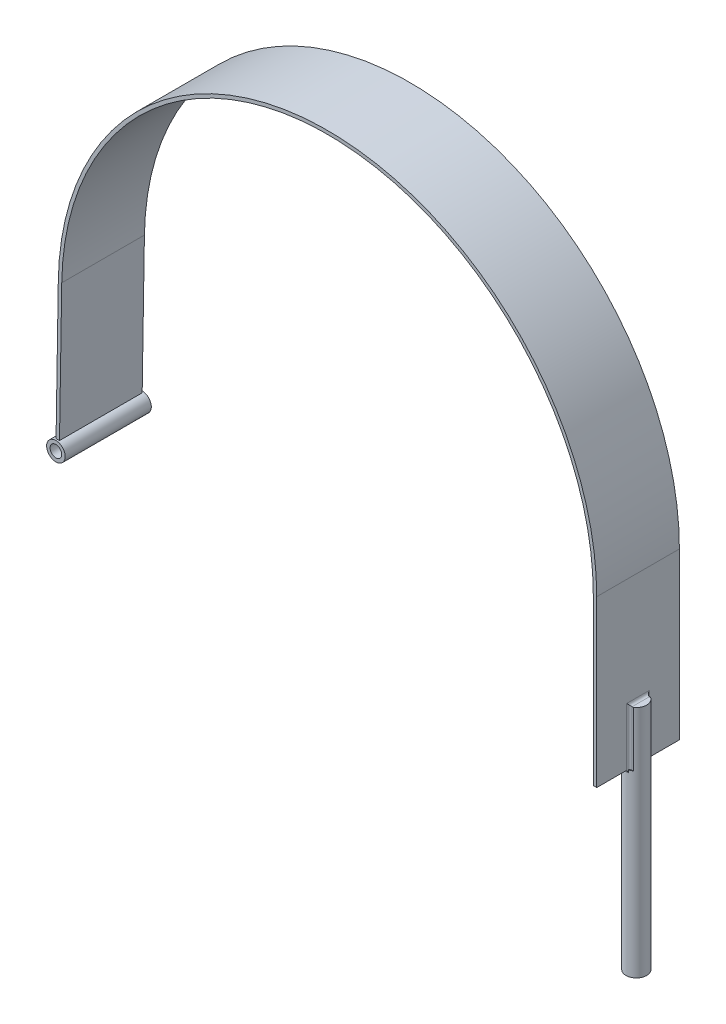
ISO-10303-21;
HEADER;
FILE_DESCRIPTION(('STEP AP214'),'2;1');
FILE_NAME('part.step','',(''),(''),'','','');
FILE_SCHEMA(('AUTOMOTIVE_DESIGN { 1 0 10303 214 1 1 1 1 }'));
ENDSEC;
DATA;
#1=APPLICATION_CONTEXT('core data for automotive mechanical design processes');
#2=APPLICATION_PROTOCOL_DEFINITION('international standard','automotive_design',2000,#1);
#3=PRODUCT_CONTEXT('',#1,'mechanical');
#4=PRODUCT('Part','Part','',(#3));
#5=PRODUCT_RELATED_PRODUCT_CATEGORY('part','',(#4));
#6=PRODUCT_DEFINITION_FORMATION('','',#4);
#7=PRODUCT_DEFINITION_CONTEXT('part definition',#1,'design');
#8=PRODUCT_DEFINITION('design','',#6,#7);
#9=PRODUCT_DEFINITION_SHAPE('','',#8);
#10=(LENGTH_UNIT() NAMED_UNIT(*) SI_UNIT(.MILLI.,.METRE.));
#11=(NAMED_UNIT(*) PLANE_ANGLE_UNIT() SI_UNIT($,.RADIAN.));
#12=(NAMED_UNIT(*) SI_UNIT($,.STERADIAN.) SOLID_ANGLE_UNIT());
#13=UNCERTAINTY_MEASURE_WITH_UNIT(LENGTH_MEASURE(1.E-05),#10,'distance_accuracy_value','');
#14=(GEOMETRIC_REPRESENTATION_CONTEXT(3) GLOBAL_UNCERTAINTY_ASSIGNED_CONTEXT((#13)) GLOBAL_UNIT_ASSIGNED_CONTEXT((#10,
#11,#12)) REPRESENTATION_CONTEXT('',''));
#15=CARTESIAN_POINT('',(0.,0.,0.));
#16=DIRECTION('',(0.,0.,1.));
#17=DIRECTION('',(1.,0.,0.));
#18=AXIS2_PLACEMENT_3D('',#15,#16,#17);
#19=CARTESIAN_POINT('',(-248.742083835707,-131.545771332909,39.6875));
#20=DIRECTION('',(0.,0.,1.));
#21=DIRECTION('',(1.,0.,0.));
#22=AXIS2_PLACEMENT_3D('',#19,#20,#21);
#23=PLANE('',#22);
#24=CARTESIAN_POINT('',(-248.742083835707,-131.545771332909,39.6875));
#25=DIRECTION('',(0.,0.,1.));
#26=DIRECTION('',(1.,0.,0.));
#27=AXIS2_PLACEMENT_3D('',#24,#25,#26);
#28=CIRCLE('',#27,8.57250000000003);
#29=CARTESIAN_POINT('',(-257.314583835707,-131.545771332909,39.6875));
#30=VERTEX_POINT('',#29);
#31=EDGE_CURVE('E11',#30,#30,#28,.T.);
#32=ORIENTED_EDGE('',*,*,#31,.T.);
#33=EDGE_LOOP('',(#32));
#34=FACE_BOUND('',#33,.T.);
#35=CARTESIAN_POINT('',(-248.742083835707,-131.545771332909,39.6875));
#36=DIRECTION('',(0.,0.,1.));
#37=DIRECTION('',(1.,0.,0.));
#38=AXIS2_PLACEMENT_3D('',#35,#36,#37);
#39=CIRCLE('',#38,5.37209999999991);
#40=CARTESIAN_POINT('',(-254.114183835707,-131.545771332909,39.6875));
#41=VERTEX_POINT('',#40);
#42=EDGE_CURVE('E45',#41,#41,#39,.T.);
#43=ORIENTED_EDGE('',*,*,#42,.F.);
#44=EDGE_LOOP('',(#43));
#45=FACE_BOUND('',#44,.T.);
#46=ADVANCED_FACE('F34',(#34,#45),#23,.T.);
#47=CARTESIAN_POINT('',(-248.742083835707,-131.545771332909,-39.6875));
#48=DIRECTION('',(0.,0.,1.));
#49=DIRECTION('',(1.,0.,0.));
#50=AXIS2_PLACEMENT_3D('',#47,#48,#49);
#51=PLANE('',#50);
#52=CARTESIAN_POINT('',(-248.742083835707,-131.545771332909,-39.6875));
#53=DIRECTION('',(0.,0.,1.));
#54=DIRECTION('',(1.,0.,0.));
#55=AXIS2_PLACEMENT_3D('',#52,#53,#54);
#56=CIRCLE('',#55,8.57250000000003);
#57=CARTESIAN_POINT('',(-257.314583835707,-131.545771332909,-39.6875));
#58=VERTEX_POINT('',#57);
#59=EDGE_CURVE('E41',#58,#58,#56,.T.);
#60=ORIENTED_EDGE('',*,*,#59,.F.);
#61=EDGE_LOOP('',(#60));
#62=FACE_BOUND('',#61,.T.);
#63=CARTESIAN_POINT('',(-248.742083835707,-131.545771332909,-39.6875));
#64=DIRECTION('',(0.,0.,1.));
#65=DIRECTION('',(1.,0.,0.));
#66=AXIS2_PLACEMENT_3D('',#63,#64,#65);
#67=CIRCLE('',#66,5.37209999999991);
#68=CARTESIAN_POINT('',(-254.114183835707,-131.545771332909,-39.6875));
#69=VERTEX_POINT('',#68);
#70=EDGE_CURVE('E49',#69,#69,#67,.T.);
#71=ORIENTED_EDGE('',*,*,#70,.T.);
#72=EDGE_LOOP('',(#71));
#73=FACE_BOUND('',#72,.T.);
#74=ADVANCED_FACE('F55',(#62,#73),#51,.F.);
#75=CARTESIAN_POINT('',(-248.742083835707,-131.545771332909,39.6875));
#76=DIRECTION('',(0.,0.,-1.));
#77=DIRECTION('',(-1.,0.,0.));
#78=AXIS2_PLACEMENT_3D('',#75,#76,#77);
#79=CYLINDRICAL_SURFACE('',#78,8.57250000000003);
#80=CARTESIAN_POINT('',(-257.314583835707,-131.545771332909,39.6875));
#81=CARTESIAN_POINT('',(-257.314583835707,-131.545771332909,38.8606770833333));
#82=CARTESIAN_POINT('',(-257.314583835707,-131.545771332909,38.0338541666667));
#83=CARTESIAN_POINT('',(-257.314583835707,-131.545771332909,36.3802083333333));
#84=CARTESIAN_POINT('',(-257.314583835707,-131.545771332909,35.5533854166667));
#85=CARTESIAN_POINT('',(-257.314583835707,-131.545771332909,33.8997395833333));
#86=CARTESIAN_POINT('',(-257.314583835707,-131.545771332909,33.0729166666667));
#87=CARTESIAN_POINT('',(-257.314583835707,-131.545771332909,31.4192708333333));
#88=CARTESIAN_POINT('',(-257.314583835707,-131.545771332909,30.5924479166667));
#89=CARTESIAN_POINT('',(-257.314583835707,-131.545771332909,28.9388020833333));
#90=CARTESIAN_POINT('',(-257.314583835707,-131.545771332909,28.1119791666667));
#91=CARTESIAN_POINT('',(-257.314583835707,-131.545771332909,26.4583333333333));
#92=CARTESIAN_POINT('',(-257.314583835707,-131.545771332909,25.6315104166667));
#93=CARTESIAN_POINT('',(-257.314583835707,-131.545771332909,23.9778645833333));
#94=CARTESIAN_POINT('',(-257.314583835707,-131.545771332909,23.1510416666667));
#95=CARTESIAN_POINT('',(-257.314583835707,-131.545771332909,21.4973958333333));
#96=CARTESIAN_POINT('',(-257.314583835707,-131.545771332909,20.6705729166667));
#97=CARTESIAN_POINT('',(-257.314583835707,-131.545771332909,19.0169270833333));
#98=CARTESIAN_POINT('',(-257.314583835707,-131.545771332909,18.1901041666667));
#99=CARTESIAN_POINT('',(-257.314583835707,-131.545771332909,16.5364583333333));
#100=CARTESIAN_POINT('',(-257.314583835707,-131.545771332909,15.7096354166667));
#101=CARTESIAN_POINT('',(-257.314583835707,-131.545771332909,14.0559895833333));
#102=CARTESIAN_POINT('',(-257.314583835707,-131.545771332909,13.2291666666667));
#103=CARTESIAN_POINT('',(-257.314583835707,-131.545771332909,11.5755208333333));
#104=CARTESIAN_POINT('',(-257.314583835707,-131.545771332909,10.7486979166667));
#105=CARTESIAN_POINT('',(-257.314583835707,-131.545771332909,9.09505208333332));
#106=CARTESIAN_POINT('',(-257.314583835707,-131.545771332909,8.26822916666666));
#107=CARTESIAN_POINT('',(-257.314583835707,-131.545771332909,6.61458333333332));
#108=CARTESIAN_POINT('',(-257.314583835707,-131.545771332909,5.78776041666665));
#109=CARTESIAN_POINT('',(-257.314583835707,-131.545771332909,4.13411458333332));
#110=CARTESIAN_POINT('',(-257.314583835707,-131.545771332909,3.30729166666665));
#111=CARTESIAN_POINT('',(-257.314583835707,-131.545771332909,1.65364583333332));
#112=CARTESIAN_POINT('',(-257.314583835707,-131.545771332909,0.826822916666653));
#113=CARTESIAN_POINT('',(-257.314583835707,-131.545771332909,-0.82682291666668));
#114=CARTESIAN_POINT('',(-257.314583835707,-131.545771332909,-1.65364583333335));
#115=CARTESIAN_POINT('',(-257.314583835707,-131.545771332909,-3.30729166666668));
#116=CARTESIAN_POINT('',(-257.314583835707,-131.545771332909,-4.13411458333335));
#117=CARTESIAN_POINT('',(-257.314583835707,-131.545771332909,-5.78776041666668));
#118=CARTESIAN_POINT('',(-257.314583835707,-131.545771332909,-6.61458333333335));
#119=CARTESIAN_POINT('',(-257.314583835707,-131.545771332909,-8.26822916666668));
#120=CARTESIAN_POINT('',(-257.314583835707,-131.545771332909,-9.09505208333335));
#121=CARTESIAN_POINT('',(-257.314583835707,-131.545771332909,-10.7486979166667));
#122=CARTESIAN_POINT('',(-257.314583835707,-131.545771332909,-11.5755208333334));
#123=CARTESIAN_POINT('',(-257.314583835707,-131.545771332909,-13.2291666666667));
#124=CARTESIAN_POINT('',(-257.314583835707,-131.545771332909,-14.0559895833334));
#125=CARTESIAN_POINT('',(-257.314583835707,-131.545771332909,-15.7096354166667));
#126=CARTESIAN_POINT('',(-257.314583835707,-131.545771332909,-16.5364583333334));
#127=CARTESIAN_POINT('',(-257.314583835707,-131.545771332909,-18.1901041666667));
#128=CARTESIAN_POINT('',(-257.314583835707,-131.545771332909,-19.0169270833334));
#129=CARTESIAN_POINT('',(-257.314583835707,-131.545771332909,-20.6705729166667));
#130=CARTESIAN_POINT('',(-257.314583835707,-131.545771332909,-21.4973958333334));
#131=CARTESIAN_POINT('',(-257.314583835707,-131.545771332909,-23.1510416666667));
#132=CARTESIAN_POINT('',(-257.314583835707,-131.545771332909,-23.9778645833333));
#133=CARTESIAN_POINT('',(-257.314583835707,-131.545771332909,-25.6315104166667));
#134=CARTESIAN_POINT('',(-257.314583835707,-131.545771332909,-26.4583333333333));
#135=CARTESIAN_POINT('',(-257.314583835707,-131.545771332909,-28.1119791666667));
#136=CARTESIAN_POINT('',(-257.314583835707,-131.545771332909,-28.9388020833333));
#137=CARTESIAN_POINT('',(-257.314583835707,-131.545771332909,-30.5924479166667));
#138=CARTESIAN_POINT('',(-257.314583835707,-131.545771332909,-31.4192708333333));
#139=CARTESIAN_POINT('',(-257.314583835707,-131.545771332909,-33.0729166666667));
#140=CARTESIAN_POINT('',(-257.314583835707,-131.545771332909,-33.8997395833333));
#141=CARTESIAN_POINT('',(-257.314583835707,-131.545771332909,-35.5533854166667));
#142=CARTESIAN_POINT('',(-257.314583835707,-131.545771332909,-36.3802083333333));
#143=CARTESIAN_POINT('',(-257.314583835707,-131.545771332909,-38.0338541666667));
#144=CARTESIAN_POINT('',(-257.314583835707,-131.545771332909,-38.8606770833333));
#145=CARTESIAN_POINT('',(-257.314583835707,-131.545771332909,-39.6875));
#146=B_SPLINE_CURVE_WITH_KNOTS('',3,(#80,#81,#82,#83,#84,#85,#86,#87,#88,#89,#90,#91,#92,#93,
#94,#95,#96,#97,#98,#99,#100,#101,#102,#103,#104,#105,#106,#107,#108,#109,#110,#111,#112,#113,
#114,#115,#116,#117,#118,#119,#120,#121,#122,#123,#124,#125,#126,#127,#128,#129,#130,#131,#132,
#133,#134,#135,#136,#137,#138,#139,#140,#141,#142,#143,#144,#145),.UNSPECIFIED.,.F.,.F.,(4,2,2,
2,2,2,2,2,2,2,2,2,2,2,2,2,2,2,2,2,2,2,2,2,2,2,2,2,2,2,2,2,4),(0.,2.48046875,4.9609375,
7.44140625,9.921875,12.40234375,14.8828125,17.36328125,19.84375,22.32421875,24.8046875,
27.28515625,29.765625,32.24609375,34.7265625,37.20703125,39.6875,42.16796875,44.6484375,
47.12890625,49.609375,52.08984375,54.5703125,57.05078125,59.53125,62.01171875,64.4921875,
66.97265625,69.453125,71.93359375,74.4140625,76.89453125,79.375),.UNSPECIFIED.);
#147=EDGE_CURVE('BSEAM36',#30,#58,#146,.T.);
#148=ORIENTED_EDGE('',*,*,#31,.F.);
#149=ORIENTED_EDGE('',*,*,#59,.T.);
#150=ORIENTED_EDGE('',*,*,#147,.T.);
#151=ORIENTED_EDGE('',*,*,#147,.F.);
#152=EDGE_LOOP('',(#148,#150,#149,#151));
#153=FACE_BOUND('',#152,.T.);
#154=ADVANCED_FACE('F36',(#153),#79,.T.);
#155=CARTESIAN_POINT('',(-248.742083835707,-131.545771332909,39.6875));
#156=DIRECTION('',(0.,0.,-1.));
#157=DIRECTION('',(-1.,0.,0.));
#158=AXIS2_PLACEMENT_3D('',#155,#156,#157);
#159=CYLINDRICAL_SURFACE('',#158,5.37209999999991);
#160=CARTESIAN_POINT('',(-254.114183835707,-131.545771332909,39.6875));
#161=CARTESIAN_POINT('',(-254.114183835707,-131.545771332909,38.8606770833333));
#162=CARTESIAN_POINT('',(-254.114183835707,-131.545771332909,38.0338541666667));
#163=CARTESIAN_POINT('',(-254.114183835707,-131.545771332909,36.3802083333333));
#164=CARTESIAN_POINT('',(-254.114183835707,-131.545771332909,35.5533854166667));
#165=CARTESIAN_POINT('',(-254.114183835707,-131.545771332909,33.8997395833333));
#166=CARTESIAN_POINT('',(-254.114183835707,-131.545771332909,33.0729166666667));
#167=CARTESIAN_POINT('',(-254.114183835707,-131.545771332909,31.4192708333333));
#168=CARTESIAN_POINT('',(-254.114183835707,-131.545771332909,30.5924479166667));
#169=CARTESIAN_POINT('',(-254.114183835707,-131.545771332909,28.9388020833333));
#170=CARTESIAN_POINT('',(-254.114183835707,-131.545771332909,28.1119791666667));
#171=CARTESIAN_POINT('',(-254.114183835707,-131.545771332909,26.4583333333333));
#172=CARTESIAN_POINT('',(-254.114183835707,-131.545771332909,25.6315104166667));
#173=CARTESIAN_POINT('',(-254.114183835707,-131.545771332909,23.9778645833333));
#174=CARTESIAN_POINT('',(-254.114183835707,-131.545771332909,23.1510416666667));
#175=CARTESIAN_POINT('',(-254.114183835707,-131.545771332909,21.4973958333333));
#176=CARTESIAN_POINT('',(-254.114183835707,-131.545771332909,20.6705729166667));
#177=CARTESIAN_POINT('',(-254.114183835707,-131.545771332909,19.0169270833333));
#178=CARTESIAN_POINT('',(-254.114183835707,-131.545771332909,18.1901041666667));
#179=CARTESIAN_POINT('',(-254.114183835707,-131.545771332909,16.5364583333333));
#180=CARTESIAN_POINT('',(-254.114183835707,-131.545771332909,15.7096354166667));
#181=CARTESIAN_POINT('',(-254.114183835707,-131.545771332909,14.0559895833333));
#182=CARTESIAN_POINT('',(-254.114183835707,-131.545771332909,13.2291666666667));
#183=CARTESIAN_POINT('',(-254.114183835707,-131.545771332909,11.5755208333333));
#184=CARTESIAN_POINT('',(-254.114183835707,-131.545771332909,10.7486979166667));
#185=CARTESIAN_POINT('',(-254.114183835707,-131.545771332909,9.09505208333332));
#186=CARTESIAN_POINT('',(-254.114183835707,-131.545771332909,8.26822916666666));
#187=CARTESIAN_POINT('',(-254.114183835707,-131.545771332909,6.61458333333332));
#188=CARTESIAN_POINT('',(-254.114183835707,-131.545771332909,5.78776041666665));
#189=CARTESIAN_POINT('',(-254.114183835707,-131.545771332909,4.13411458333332));
#190=CARTESIAN_POINT('',(-254.114183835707,-131.545771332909,3.30729166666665));
#191=CARTESIAN_POINT('',(-254.114183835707,-131.545771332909,1.65364583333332));
#192=CARTESIAN_POINT('',(-254.114183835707,-131.545771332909,0.826822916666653));
#193=CARTESIAN_POINT('',(-254.114183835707,-131.545771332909,-0.82682291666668));
#194=CARTESIAN_POINT('',(-254.114183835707,-131.545771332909,-1.65364583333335));
#195=CARTESIAN_POINT('',(-254.114183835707,-131.545771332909,-3.30729166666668));
#196=CARTESIAN_POINT('',(-254.114183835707,-131.545771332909,-4.13411458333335));
#197=CARTESIAN_POINT('',(-254.114183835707,-131.545771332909,-5.78776041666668));
#198=CARTESIAN_POINT('',(-254.114183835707,-131.545771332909,-6.61458333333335));
#199=CARTESIAN_POINT('',(-254.114183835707,-131.545771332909,-8.26822916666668));
#200=CARTESIAN_POINT('',(-254.114183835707,-131.545771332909,-9.09505208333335));
#201=CARTESIAN_POINT('',(-254.114183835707,-131.545771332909,-10.7486979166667));
#202=CARTESIAN_POINT('',(-254.114183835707,-131.545771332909,-11.5755208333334));
#203=CARTESIAN_POINT('',(-254.114183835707,-131.545771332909,-13.2291666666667));
#204=CARTESIAN_POINT('',(-254.114183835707,-131.545771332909,-14.0559895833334));
#205=CARTESIAN_POINT('',(-254.114183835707,-131.545771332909,-15.7096354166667));
#206=CARTESIAN_POINT('',(-254.114183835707,-131.545771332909,-16.5364583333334));
#207=CARTESIAN_POINT('',(-254.114183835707,-131.545771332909,-18.1901041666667));
#208=CARTESIAN_POINT('',(-254.114183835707,-131.545771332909,-19.0169270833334));
#209=CARTESIAN_POINT('',(-254.114183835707,-131.545771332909,-20.6705729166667));
#210=CARTESIAN_POINT('',(-254.114183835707,-131.545771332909,-21.4973958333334));
#211=CARTESIAN_POINT('',(-254.114183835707,-131.545771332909,-23.1510416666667));
#212=CARTESIAN_POINT('',(-254.114183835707,-131.545771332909,-23.9778645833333));
#213=CARTESIAN_POINT('',(-254.114183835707,-131.545771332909,-25.6315104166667));
#214=CARTESIAN_POINT('',(-254.114183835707,-131.545771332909,-26.4583333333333));
#215=CARTESIAN_POINT('',(-254.114183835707,-131.545771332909,-28.1119791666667));
#216=CARTESIAN_POINT('',(-254.114183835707,-131.545771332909,-28.9388020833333));
#217=CARTESIAN_POINT('',(-254.114183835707,-131.545771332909,-30.5924479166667));
#218=CARTESIAN_POINT('',(-254.114183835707,-131.545771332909,-31.4192708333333));
#219=CARTESIAN_POINT('',(-254.114183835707,-131.545771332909,-33.0729166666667));
#220=CARTESIAN_POINT('',(-254.114183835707,-131.545771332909,-33.8997395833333));
#221=CARTESIAN_POINT('',(-254.114183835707,-131.545771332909,-35.5533854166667));
#222=CARTESIAN_POINT('',(-254.114183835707,-131.545771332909,-36.3802083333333));
#223=CARTESIAN_POINT('',(-254.114183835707,-131.545771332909,-38.0338541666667));
#224=CARTESIAN_POINT('',(-254.114183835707,-131.545771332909,-38.8606770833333));
#225=CARTESIAN_POINT('',(-254.114183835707,-131.545771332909,-39.6875));
#226=B_SPLINE_CURVE_WITH_KNOTS('',3,(#160,#161,#162,#163,#164,#165,#166,#167,#168,#169,#170,
#171,#172,#173,#174,#175,#176,#177,#178,#179,#180,#181,#182,#183,#184,#185,#186,#187,#188,#189,
#190,#191,#192,#193,#194,#195,#196,#197,#198,#199,#200,#201,#202,#203,#204,#205,#206,#207,#208,
#209,#210,#211,#212,#213,#214,#215,#216,#217,#218,#219,#220,#221,#222,#223,#224,#225),
.UNSPECIFIED.,.F.,.F.,(4,2,2,2,2,2,2,2,2,2,2,2,2,2,2,2,2,2,2,2,2,2,2,2,2,2,2,2,2,2,2,2,4),(0.,
2.48046875,4.9609375,7.44140625,9.921875,12.40234375,14.8828125,17.36328125,19.84375,
22.32421875,24.8046875,27.28515625,29.765625,32.24609375,34.7265625,37.20703125,39.6875,
42.16796875,44.6484375,47.12890625,49.609375,52.08984375,54.5703125,57.05078125,59.53125,
62.01171875,64.4921875,66.97265625,69.453125,71.93359375,74.4140625,76.89453125,79.375),.UNSPECIFIED.);
#227=EDGE_CURVE('BSEAM57',#41,#69,#226,.T.);
#228=ORIENTED_EDGE('',*,*,#42,.T.);
#229=ORIENTED_EDGE('',*,*,#70,.F.);
#230=ORIENTED_EDGE('',*,*,#227,.T.);
#231=ORIENTED_EDGE('',*,*,#227,.F.);
#232=EDGE_LOOP('',(#228,#230,#229,#231));
#233=FACE_BOUND('',#232,.T.);
#234=ADVANCED_FACE('F57',(#233),#159,.F.);
#235=CLOSED_SHELL('',(#46,#74,#154,#234));
#236=MANIFOLD_SOLID_BREP('B2',#235);
#237=CARTESIAN_POINT('',(246.5578,-152.4,0.));
#238=DIRECTION('',(0.,-1.,0.));
#239=DIRECTION('',(0.,0.,-1.));
#240=AXIS2_PLACEMENT_3D('',#237,#238,#239);
#241=PLANE('',#240);
#242=CARTESIAN_POINT('',(246.5578,-152.4,0.));
#243=DIRECTION('',(0.,-1.,0.));
#244=DIRECTION('',(0.,0.,-1.));
#245=AXIS2_PLACEMENT_3D('',#242,#243,#244);
#246=CIRCLE('',#245,9.52500000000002);
#247=CARTESIAN_POINT('',(244.680095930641,-152.4,9.33808612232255));
#248=VERTEX_POINT('',#247);
#249=CARTESIAN_POINT('',(241.389664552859,-152.4,8.00099999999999));
#250=VERTEX_POINT('',#249);
#251=EDGE_CURVE('E266',#248,#250,#246,.T.);
#252=ORIENTED_EDGE('',*,*,#251,.F.);
#253=CARTESIAN_POINT('',(242.443,-152.4,10.541));
#254=DIRECTION('',(0.,-1.,0.));
#255=DIRECTION('',(0.,0.,-1.));
#256=AXIS2_PLACEMENT_3D('',#253,#254,#255);
#257=CIRCLE('',#256,2.54);
#258=CARTESIAN_POINT('',(242.443,-152.4,8.00099999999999));
#259=VERTEX_POINT('',#258);
#260=EDGE_CURVE('E292',#248,#259,#257,.F.);
#261=ORIENTED_EDGE('',*,*,#260,.T.);
#262=DIRECTION('',(1.,0.,0.));
#263=VECTOR('',#262,1.);
#264=CARTESIAN_POINT('',(241.389664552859,-152.4,8.00099999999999));
#265=LINE('',#264,#263);
#266=EDGE_CURVE('E285',#250,#259,#265,.T.);
#267=ORIENTED_EDGE('',*,*,#266,.F.);
#268=EDGE_LOOP('',(#252,#261,#267));
#269=FACE_BOUND('',#268,.T.);
#270=ADVANCED_FACE('F88',(#269),#241,.F.);
#271=CARTESIAN_POINT('',(250.698,-152.4,8.00099999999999));
#272=VERTEX_POINT('',#271);
#273=CARTESIAN_POINT('',(251.725935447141,-152.4,8.001));
#274=VERTEX_POINT('',#273);
#275=EDGE_CURVE('E294',#272,#274,#265,.T.);
#276=ORIENTED_EDGE('',*,*,#275,.F.);
#277=CARTESIAN_POINT('',(250.698,-152.4,10.541));
#278=DIRECTION('',(0.,-1.,0.));
#279=DIRECTION('',(0.,0.,-1.));
#280=AXIS2_PLACEMENT_3D('',#277,#278,#279);
#281=CIRCLE('',#280,2.54);
#282=CARTESIAN_POINT('',(248.464021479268,-152.4,9.33230650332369));
#283=VERTEX_POINT('',#282);
#284=EDGE_CURVE('E417',#272,#283,#281,.F.);
#285=ORIENTED_EDGE('',*,*,#284,.T.);
#286=EDGE_CURVE('E278',#274,#283,#246,.T.);
#287=ORIENTED_EDGE('',*,*,#286,.F.);
#288=EDGE_LOOP('',(#276,#285,#287));
#289=FACE_BOUND('',#288,.T.);
#290=ADVANCED_FACE('F504',(#289),#241,.F.);
#291=CARTESIAN_POINT('',(248.464021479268,-152.4,-9.33230650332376));
#292=VERTEX_POINT('',#291);
#293=CARTESIAN_POINT('',(251.725935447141,-152.4,-8.00100000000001));
#294=VERTEX_POINT('',#293);
#295=EDGE_CURVE('E281',#292,#294,#246,.T.);
#296=ORIENTED_EDGE('',*,*,#295,.F.);
#297=CARTESIAN_POINT('',(250.698,-152.4,-10.541));
#298=DIRECTION('',(0.,-1.,0.));
#299=DIRECTION('',(0.,0.,-1.));
#300=AXIS2_PLACEMENT_3D('',#297,#298,#299);
#301=CIRCLE('',#300,2.54);
#302=CARTESIAN_POINT('',(250.698,-152.4,-8.00100000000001));
#303=VERTEX_POINT('',#302);
#304=EDGE_CURVE('E413',#292,#303,#301,.F.);
#305=ORIENTED_EDGE('',*,*,#304,.T.);
#306=DIRECTION('',(-1.,0.,0.));
#307=VECTOR('',#306,1.);
#308=CARTESIAN_POINT('',(241.389664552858,-152.4,-8.00100000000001));
#309=LINE('',#308,#307);
#310=EDGE_CURVE('E296',#294,#303,#309,.T.);
#311=ORIENTED_EDGE('',*,*,#310,.F.);
#312=EDGE_LOOP('',(#296,#305,#311));
#313=FACE_BOUND('',#312,.T.);
#314=ADVANCED_FACE('F632',(#313),#241,.F.);
#315=CARTESIAN_POINT('',(242.443,-152.4,-8.00100000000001));
#316=VERTEX_POINT('',#315);
#317=CARTESIAN_POINT('',(241.389664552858,-152.4,-8.001));
#318=VERTEX_POINT('',#317);
#319=EDGE_CURVE('E293',#316,#318,#309,.T.);
#320=ORIENTED_EDGE('',*,*,#319,.F.);
#321=CARTESIAN_POINT('',(242.443,-152.4,-10.541));
#322=DIRECTION('',(0.,-1.,0.));
#323=DIRECTION('',(0.,0.,-1.));
#324=AXIS2_PLACEMENT_3D('',#321,#322,#323);
#325=CIRCLE('',#324,2.54);
#326=CARTESIAN_POINT('',(244.680095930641,-152.4,-9.3380861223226));
#327=VERTEX_POINT('',#326);
#328=EDGE_CURVE('E402',#316,#327,#325,.F.);
#329=ORIENTED_EDGE('',*,*,#328,.T.);
#330=EDGE_CURVE('E279',#318,#327,#246,.T.);
#331=ORIENTED_EDGE('',*,*,#330,.F.);
#332=EDGE_LOOP('',(#320,#329,#331));
#333=FACE_BOUND('',#332,.T.);
#334=ADVANCED_FACE('F505',(#333),#241,.F.);
#335=CARTESIAN_POINT('',(248.158,-152.4,38.1));
#336=DIRECTION('',(0.,-1.,0.));
#337=DIRECTION('',(0.,0.,-1.));
#338=AXIS2_PLACEMENT_3D('',#335,#336,#337);
#339=PLANE('',#338);
#340=DIRECTION('',(0.,0.,-1.));
#341=VECTOR('',#340,1.);
#342=CARTESIAN_POINT('',(244.983,-152.4,38.1));
#343=LINE('',#342,#341);
#344=CARTESIAN_POINT('',(244.983,-152.4,38.1));
#345=VERTEX_POINT('',#344);
#346=CARTESIAN_POINT('',(244.983,-152.4,11.9617820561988));
#347=VERTEX_POINT('',#346);
#348=EDGE_CURVE('E386',#345,#347,#343,.T.);
#349=ORIENTED_EDGE('',*,*,#348,.T.);
#350=CARTESIAN_POINT('',(246.5578,-152.4,0.));
#351=DIRECTION('',(0.,-1.,0.));
#352=DIRECTION('',(0.,0.,-1.));
#353=AXIS2_PLACEMENT_3D('',#350,#351,#352);
#354=CIRCLE('',#353,12.065);
#355=CARTESIAN_POINT('',(248.158,-152.4,11.9584106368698));
#356=VERTEX_POINT('',#355);
#357=EDGE_CURVE('E435',#347,#356,#354,.F.);
#358=ORIENTED_EDGE('',*,*,#357,.T.);
#359=DIRECTION('',(0.,0.,-1.));
#360=VECTOR('',#359,1.);
#361=CARTESIAN_POINT('',(248.158,-152.4,38.1));
#362=LINE('',#361,#360);
#363=CARTESIAN_POINT('',(248.158,-152.4,38.1));
#364=VERTEX_POINT('',#363);
#365=EDGE_CURVE('E382',#364,#356,#362,.T.);
#366=ORIENTED_EDGE('',*,*,#365,.F.);
#367=DIRECTION('',(-1.,0.,0.));
#368=VECTOR('',#367,1.);
#369=CARTESIAN_POINT('',(248.158,-152.4,38.1));
#370=LINE('',#369,#368);
#371=EDGE_CURVE('E348',#364,#345,#370,.T.);
#372=ORIENTED_EDGE('',*,*,#371,.T.);
#373=EDGE_LOOP('',(#349,#358,#366,#372));
#374=FACE_BOUND('',#373,.T.);
#375=ADVANCED_FACE('F544',(#374),#339,.T.);
#376=CARTESIAN_POINT('',(248.158,-152.4,-11.9584106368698));
#377=VERTEX_POINT('',#376);
#378=CARTESIAN_POINT('',(248.158,-152.4,-38.1));
#379=VERTEX_POINT('',#378);
#380=EDGE_CURVE('E381',#377,#379,#362,.T.);
#381=ORIENTED_EDGE('',*,*,#380,.F.);
#382=CARTESIAN_POINT('',(246.5578,-152.4,0.));
#383=DIRECTION('',(0.,-1.,0.));
#384=DIRECTION('',(0.,0.,-1.));
#385=AXIS2_PLACEMENT_3D('',#382,#383,#384);
#386=CIRCLE('',#385,12.065);
#387=CARTESIAN_POINT('',(244.983,-152.4,-11.9617820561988));
#388=VERTEX_POINT('',#387);
#389=EDGE_CURVE('E433',#377,#388,#386,.F.);
#390=ORIENTED_EDGE('',*,*,#389,.T.);
#391=CARTESIAN_POINT('',(244.983,-152.4,-38.1));
#392=VERTEX_POINT('',#391);
#393=EDGE_CURVE('E385',#388,#392,#343,.T.);
#394=ORIENTED_EDGE('',*,*,#393,.T.);
#395=DIRECTION('',(-1.,0.,0.));
#396=VECTOR('',#395,1.);
#397=CARTESIAN_POINT('',(248.158,-152.4,-38.1));
#398=LINE('',#397,#396);
#399=EDGE_CURVE('E327',#379,#392,#398,.T.);
#400=ORIENTED_EDGE('',*,*,#399,.F.);
#401=EDGE_LOOP('',(#381,#390,#394,#400));
#402=FACE_BOUND('',#401,.T.);
#403=ADVANCED_FACE('F587',(#402),#339,.T.);
#404=CARTESIAN_POINT('',(244.983,0.,38.1));
#405=DIRECTION('',(1.,0.,0.));
#406=DIRECTION('',(0.,0.,-1.));
#407=AXIS2_PLACEMENT_3D('',#404,#405,#406);
#408=PLANE('',#407);
#409=DIRECTION('',(0.,0.,1.));
#410=VECTOR('',#409,1.);
#411=CARTESIAN_POINT('',(244.983,-99.06,38.1));
#412=LINE('',#411,#410);
#413=CARTESIAN_POINT('',(244.983,-99.06,-10.541));
#414=VERTEX_POINT('',#413);
#415=CARTESIAN_POINT('',(244.983,-99.06,10.541));
#416=VERTEX_POINT('',#415);
#417=EDGE_CURVE('E391',#414,#416,#412,.T.);
#418=ORIENTED_EDGE('',*,*,#417,.T.);
#419=DIRECTION('',(0.,-1.,0.));
#420=VECTOR('',#419,1.);
#421=CARTESIAN_POINT('',(244.983,-152.4,10.541));
#422=LINE('',#421,#420);
#423=CARTESIAN_POINT('',(244.983,-152.825310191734,10.541));
#424=VERTEX_POINT('',#423);
#425=EDGE_CURVE('E393',#416,#424,#422,.T.);
#426=ORIENTED_EDGE('',*,*,#425,.T.);
#427=CARTESIAN_POINT('',(244.983,-152.825310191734,10.541));
#428=CARTESIAN_POINT('',(244.983,-152.784881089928,10.602424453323));
#429=CARTESIAN_POINT('',(244.983,-152.747095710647,10.665586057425));
#430=CARTESIAN_POINT('',(244.983,-152.677044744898,10.7949095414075));
#431=CARTESIAN_POINT('',(244.983,-152.644779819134,10.8610717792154));
#432=CARTESIAN_POINT('',(244.983,-152.586712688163,10.9942996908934));
#433=CARTESIAN_POINT('',(244.983,-152.560774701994,11.0613061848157));
#434=CARTESIAN_POINT('',(244.983,-152.514566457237,11.1972192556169));
#435=CARTESIAN_POINT('',(244.983,-152.494294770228,11.2661253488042));
#436=CARTESIAN_POINT('',(244.983,-152.451648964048,11.4370967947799));
#437=CARTESIAN_POINT('',(244.983,-152.432513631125,11.5399867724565));
#438=CARTESIAN_POINT('',(244.983,-152.406557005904,11.7491665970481));
#439=CARTESIAN_POINT('',(244.983,-152.399960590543,11.8554843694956));
#440=CARTESIAN_POINT('',(244.983,-152.4,11.9617820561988));
#441=B_SPLINE_CURVE_WITH_KNOTS('',3,(#427,#428,#429,#430,#431,#432,#433,#434,#435,#436,#437,
#438,#439,#440),.UNSPECIFIED.,.F.,.F.,(4,2,2,2,2,2,4),(0.,0.220535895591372,0.441098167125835,
0.65640011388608,0.87164773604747,1.18481520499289,1.50354799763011),.UNSPECIFIED.);
#442=EDGE_CURVE('E549',#424,#347,#441,.T.);
#443=ORIENTED_EDGE('',*,*,#442,.T.);
#444=ORIENTED_EDGE('',*,*,#348,.F.);
#445=DIRECTION('',(0.,1.,0.));
#446=VECTOR('',#445,1.);
#447=CARTESIAN_POINT('',(244.983,0.,38.1));
#448=LINE('',#447,#446);
#449=CARTESIAN_POINT('',(244.983,0.,38.1));
#450=VERTEX_POINT('',#449);
#451=EDGE_CURVE('E346',#450,#345,#448,.F.);
#452=ORIENTED_EDGE('',*,*,#451,.F.);
#453=DIRECTION('',(0.,0.,-1.));
#454=VECTOR('',#453,1.);
#455=CARTESIAN_POINT('',(244.983,0.,38.1));
#456=LINE('',#455,#454);
#457=CARTESIAN_POINT('',(244.983,0.,-38.1));
#458=VERTEX_POINT('',#457);
#459=EDGE_CURVE('E367',#450,#458,#456,.T.);
#460=ORIENTED_EDGE('',*,*,#459,.T.);
#461=DIRECTION('',(0.,1.,0.));
#462=VECTOR('',#461,1.);
#463=CARTESIAN_POINT('',(244.983,0.,-38.1));
#464=LINE('',#463,#462);
#465=EDGE_CURVE('E324',#458,#392,#464,.F.);
#466=ORIENTED_EDGE('',*,*,#465,.T.);
#467=ORIENTED_EDGE('',*,*,#393,.F.);
#468=CARTESIAN_POINT('',(244.983,-152.4,-11.9617820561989));
#469=CARTESIAN_POINT('',(244.983,-152.399992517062,-11.888219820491));
#470=CARTESIAN_POINT('',(244.983,-152.403141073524,-11.8146591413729));
#471=CARTESIAN_POINT('',(244.983,-152.415690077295,-11.6680626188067));
#472=CARTESIAN_POINT('',(244.983,-152.425091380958,-11.5950268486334));
#473=CARTESIAN_POINT('',(244.983,-152.449787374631,-11.4517528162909));
#474=CARTESIAN_POINT('',(244.983,-152.464936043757,-11.3814893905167));
#475=CARTESIAN_POINT('',(244.983,-152.501015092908,-11.2424898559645));
#476=CARTESIAN_POINT('',(244.983,-152.521943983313,-11.1737533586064));
#477=CARTESIAN_POINT('',(244.983,-152.580245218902,-11.0074965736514));
#478=CARTESIAN_POINT('',(244.983,-152.620770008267,-10.9110643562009));
#479=CARTESIAN_POINT('',(244.983,-152.713982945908,-10.7221313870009));
#480=CARTESIAN_POINT('',(244.983,-152.766874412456,-10.6297309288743));
#481=CARTESIAN_POINT('',(244.983,-152.825310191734,-10.541));
#482=B_SPLINE_CURVE_WITH_KNOTS('',3,(#468,#469,#470,#471,#472,#473,#474,#475,#476,#477,#478,
#479,#480,#481),.UNSPECIFIED.,.F.,.F.,(4,2,2,2,2,2,4),(0.,0.220617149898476,0.441264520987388,
0.656645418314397,0.871970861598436,1.18497856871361,1.5035476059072),.UNSPECIFIED.);
#483=CARTESIAN_POINT('',(244.983,-152.825310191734,-10.541));
#484=VERTEX_POINT('',#483);
#485=EDGE_CURVE('E464',#388,#484,#482,.T.);
#486=ORIENTED_EDGE('',*,*,#485,.T.);
#487=DIRECTION('',(0.,1.,0.));
#488=VECTOR('',#487,1.);
#489=CARTESIAN_POINT('',(244.983,-101.6,-10.541));
#490=LINE('',#489,#488);
#491=EDGE_CURVE('E389',#484,#414,#490,.T.);
#492=ORIENTED_EDGE('',*,*,#491,.T.);
#493=EDGE_LOOP('',(#418,#426,#443,#444,#452,#460,#466,#467,#486,#492));
#494=FACE_BOUND('',#493,.T.);
#495=ADVANCED_FACE('F90',(#494),#408,.F.);
#496=CARTESIAN_POINT('',(248.158,0.,38.1));
#497=DIRECTION('',(1.,0.,0.));
#498=DIRECTION('',(0.,0.,-1.));
#499=AXIS2_PLACEMENT_3D('',#496,#497,#498);
#500=PLANE('',#499);
#501=DIRECTION('',(0.,0.,1.));
#502=VECTOR('',#501,1.);
#503=CARTESIAN_POINT('',(248.158,-99.06,-8.00100000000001));
#504=LINE('',#503,#502);
#505=CARTESIAN_POINT('',(248.158,-99.06,10.541));
#506=VERTEX_POINT('',#505);
#507=CARTESIAN_POINT('',(248.158,-99.06,-10.541));
#508=VERTEX_POINT('',#507);
#509=EDGE_CURVE('E408',#506,#508,#504,.F.);
#510=ORIENTED_EDGE('',*,*,#509,.T.);
#511=DIRECTION('',(0.,1.,0.));
#512=VECTOR('',#511,1.);
#513=CARTESIAN_POINT('',(248.158,0.,-10.541));
#514=LINE('',#513,#512);
#515=CARTESIAN_POINT('',(248.158,-152.822798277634,-10.541));
#516=VERTEX_POINT('',#515);
#517=EDGE_CURVE('E411',#508,#516,#514,.F.);
#518=ORIENTED_EDGE('',*,*,#517,.T.);
#519=CARTESIAN_POINT('',(248.158,-152.822798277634,-10.541));
#520=CARTESIAN_POINT('',(248.158,-152.782466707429,-10.6025362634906));
#521=CARTESIAN_POINT('',(248.158,-152.744783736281,-10.6658055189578));
#522=CARTESIAN_POINT('',(248.158,-152.674946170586,-10.7953354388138));
#523=CARTESIAN_POINT('',(248.158,-152.642792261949,-10.8615964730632));
#524=CARTESIAN_POINT('',(248.158,-152.584949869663,-10.9950150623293));
#525=CARTESIAN_POINT('',(248.158,-152.559125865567,-11.062113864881));
#526=CARTESIAN_POINT('',(248.158,-152.513153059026,-11.1982016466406));
#527=CARTESIAN_POINT('',(248.158,-152.493002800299,-11.2671901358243));
#528=CARTESIAN_POINT('',(248.158,-152.450860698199,-11.4375512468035));
#529=CARTESIAN_POINT('',(248.158,-152.432014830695,-11.5397179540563));
#530=CARTESIAN_POINT('',(248.158,-152.406455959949,-11.7473817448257));
#531=CARTESIAN_POINT('',(248.158,-152.399961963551,-11.8529058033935));
#532=CARTESIAN_POINT('',(248.158,-152.4,-11.9584106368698));
#533=B_SPLINE_CURVE_WITH_KNOTS('',3,(#519,#520,#521,#522,#523,#524,#525,#526,#527,#528,#529,
#530,#531,#532),.UNSPECIFIED.,.F.,.F.,(4,2,2,2,2,2,4),(0.,0.220655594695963,0.441338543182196,
0.656775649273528,0.872157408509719,1.18305182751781,1.49940901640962),.UNSPECIFIED.);
#534=EDGE_CURVE('E445',#516,#377,#533,.T.);
#535=ORIENTED_EDGE('',*,*,#534,.T.);
#536=ORIENTED_EDGE('',*,*,#380,.T.);
#537=DIRECTION('',(0.,-1.,0.));
#538=VECTOR('',#537,1.);
#539=CARTESIAN_POINT('',(248.158,0.,-38.1));
#540=LINE('',#539,#538);
#541=CARTESIAN_POINT('',(248.158,0.,-38.1));
#542=VERTEX_POINT('',#541);
#543=EDGE_CURVE('E330',#542,#379,#540,.T.);
#544=ORIENTED_EDGE('',*,*,#543,.F.);
#545=DIRECTION('',(0.,0.,-1.));
#546=VECTOR('',#545,1.);
#547=CARTESIAN_POINT('',(248.158,0.,38.1));
#548=LINE('',#547,#546);
#549=CARTESIAN_POINT('',(248.158,0.,38.1));
#550=VERTEX_POINT('',#549);
#551=EDGE_CURVE('E379',#550,#542,#548,.T.);
#552=ORIENTED_EDGE('',*,*,#551,.F.);
#553=DIRECTION('',(0.,-1.,0.));
#554=VECTOR('',#553,1.);
#555=CARTESIAN_POINT('',(248.158,0.,38.1));
#556=LINE('',#555,#554);
#557=EDGE_CURVE('E351',#550,#364,#556,.T.);
#558=ORIENTED_EDGE('',*,*,#557,.T.);
#559=ORIENTED_EDGE('',*,*,#365,.T.);
#560=CARTESIAN_POINT('',(248.158,-152.4,11.9584106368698));
#561=CARTESIAN_POINT('',(248.158,-152.399992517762,11.884808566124));
#562=CARTESIAN_POINT('',(248.158,-152.403142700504,11.8112080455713));
#563=CARTESIAN_POINT('',(248.158,-152.41569807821,11.6645317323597));
#564=CARTESIAN_POINT('',(248.158,-152.425104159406,11.591456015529));
#565=CARTESIAN_POINT('',(248.158,-152.449813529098,11.4480978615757));
#566=CARTESIAN_POINT('',(248.158,-152.464971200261,11.3777903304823));
#567=CARTESIAN_POINT('',(248.158,-152.501072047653,11.2387037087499));
#568=CARTESIAN_POINT('',(248.158,-152.522013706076,11.1699242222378));
#569=CARTESIAN_POINT('',(248.158,-152.580077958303,11.0043406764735));
#570=CARTESIAN_POINT('',(248.158,-152.620260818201,10.9085932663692));
#571=CARTESIAN_POINT('',(248.158,-152.712608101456,10.7209651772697));
#572=CARTESIAN_POINT('',(248.158,-152.764970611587,10.6291819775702));
#573=CARTESIAN_POINT('',(248.158,-152.822798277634,10.541));
#574=B_SPLINE_CURVE_WITH_KNOTS('',3,(#560,#561,#562,#563,#564,#565,#566,#567,#568,#569,#570,
#571,#572,#573),.UNSPECIFIED.,.F.,.F.,(4,2,2,2,2,2,4),(0.,0.220736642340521,0.441504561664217,
0.657020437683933,0.872479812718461,1.18321477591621,1.49940862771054),.UNSPECIFIED.);
#575=CARTESIAN_POINT('',(248.158,-152.822798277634,10.541));
#576=VERTEX_POINT('',#575);
#577=EDGE_CURVE('E102',#356,#576,#574,.T.);
#578=ORIENTED_EDGE('',*,*,#577,.T.);
#579=DIRECTION('',(0.,-1.,0.));
#580=VECTOR('',#579,1.);
#581=CARTESIAN_POINT('',(248.158,0.,10.541));
#582=LINE('',#581,#580);
#583=EDGE_CURVE('E114',#576,#506,#582,.F.);
#584=ORIENTED_EDGE('',*,*,#583,.T.);
#585=EDGE_LOOP('',(#510,#518,#535,#536,#544,#552,#558,#559,#578,#584));
#586=FACE_BOUND('',#585,.T.);
#587=ADVANCED_FACE('F539',(#586),#500,.T.);
#588=CARTESIAN_POINT('',(0.,0.,38.1));
#589=DIRECTION('',(0.,0.,-1.));
#590=DIRECTION('',(-1.,0.,0.));
#591=AXIS2_PLACEMENT_3D('',#588,#589,#590);
#592=CYLINDRICAL_SURFACE('',#591,248.158);
#593=CARTESIAN_POINT('',(0.,0.,-38.1));
#594=DIRECTION('',(0.,0.,-1.));
#595=DIRECTION('',(1.,0.,0.));
#596=AXIS2_PLACEMENT_3D('',#593,#594,#595);
#597=CIRCLE('',#596,248.158);
#598=CARTESIAN_POINT('',(-248.125199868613,4.03461945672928,-38.1));
#599=VERTEX_POINT('',#598);
#600=EDGE_CURVE('E333',#599,#542,#597,.T.);
#601=ORIENTED_EDGE('',*,*,#600,.F.);
#602=DIRECTION('',(0.,0.,-1.));
#603=VECTOR('',#602,1.);
#604=CARTESIAN_POINT('',(-248.125199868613,4.03461945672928,38.1));
#605=LINE('',#604,#603);
#606=CARTESIAN_POINT('',(-248.125199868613,4.03461945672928,38.1));
#607=VERTEX_POINT('',#606);
#608=EDGE_CURVE('E377',#607,#599,#605,.T.);
#609=ORIENTED_EDGE('',*,*,#608,.F.);
#610=CARTESIAN_POINT('',(0.,0.,38.1));
#611=DIRECTION('',(0.,0.,-1.));
#612=DIRECTION('',(1.,0.,0.));
#613=AXIS2_PLACEMENT_3D('',#610,#611,#612);
#614=CIRCLE('',#613,248.158);
#615=EDGE_CURVE('E354',#607,#550,#614,.T.);
#616=ORIENTED_EDGE('',*,*,#615,.T.);
#617=ORIENTED_EDGE('',*,*,#551,.T.);
#618=EDGE_LOOP('',(#601,#609,#616,#617));
#619=FACE_BOUND('',#618,.T.);
#620=ADVANCED_FACE('F536',(#619),#592,.T.);
#621=CARTESIAN_POINT('',(-248.125199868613,4.03461945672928,38.1));
#622=DIRECTION('',(-0.999867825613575,0.0162582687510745,0.));
#623=DIRECTION('',(-0.0162582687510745,-0.999867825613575,0.));
#624=AXIS2_PLACEMENT_3D('',#621,#622,#623);
#625=PLANE('',#624);
#626=DIRECTION('',(0.0162582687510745,0.999867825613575,0.));
#627=VECTOR('',#626,1.);
#628=CARTESIAN_POINT('',(-248.125199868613,4.03461945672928,-38.1));
#629=LINE('',#628,#627);
#630=CARTESIAN_POINT('',(-250.19,-122.948594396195,-38.1));
#631=VERTEX_POINT('',#630);
#632=EDGE_CURVE('E336',#631,#599,#629,.T.);
#633=ORIENTED_EDGE('',*,*,#632,.F.);
#634=DIRECTION('',(0.,0.,-1.));
#635=VECTOR('',#634,1.);
#636=CARTESIAN_POINT('',(-250.19,-122.948594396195,38.1));
#637=LINE('',#636,#635);
#638=CARTESIAN_POINT('',(-250.19,-122.948594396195,38.1));
#639=VERTEX_POINT('',#638);
#640=EDGE_CURVE('E375',#639,#631,#637,.T.);
#641=ORIENTED_EDGE('',*,*,#640,.F.);
#642=DIRECTION('',(0.0162582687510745,0.999867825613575,0.));
#643=VECTOR('',#642,1.);
#644=CARTESIAN_POINT('',(-248.125199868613,4.03461945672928,38.1));
#645=LINE('',#644,#643);
#646=EDGE_CURVE('E357',#639,#607,#645,.T.);
#647=ORIENTED_EDGE('',*,*,#646,.T.);
#648=ORIENTED_EDGE('',*,*,#608,.T.);
#649=EDGE_LOOP('',(#633,#641,#647,#648));
#650=FACE_BOUND('',#649,.T.);
#651=ADVANCED_FACE('F532',(#650),#625,.T.);
#652=CARTESIAN_POINT('',(-247.015419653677,-123.000214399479,38.1));
#653=DIRECTION('',(-0.0162582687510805,-0.999867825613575,0.));
#654=DIRECTION('',(0.999867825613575,-0.0162582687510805,0.));
#655=AXIS2_PLACEMENT_3D('',#652,#653,#654);
#656=PLANE('',#655);
#657=DIRECTION('',(-0.999867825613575,0.0162582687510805,0.));
#658=VECTOR('',#657,1.);
#659=CARTESIAN_POINT('',(-247.015419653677,-123.000214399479,-38.1));
#660=LINE('',#659,#658);
#661=CARTESIAN_POINT('',(-247.015419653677,-123.000214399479,-38.1));
#662=VERTEX_POINT('',#661);
#663=EDGE_CURVE('E339',#662,#631,#660,.T.);
#664=ORIENTED_EDGE('',*,*,#663,.F.);
#665=DIRECTION('',(0.,0.,-1.));
#666=VECTOR('',#665,1.);
#667=CARTESIAN_POINT('',(-247.015419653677,-123.000214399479,38.1));
#668=LINE('',#667,#666);
#669=CARTESIAN_POINT('',(-247.015419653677,-123.000214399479,38.1));
#670=VERTEX_POINT('',#669);
#671=EDGE_CURVE('E373',#670,#662,#668,.T.);
#672=ORIENTED_EDGE('',*,*,#671,.F.);
#673=DIRECTION('',(-0.999867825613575,0.0162582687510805,0.));
#674=VECTOR('',#673,1.);
#675=CARTESIAN_POINT('',(-247.015419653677,-123.000214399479,38.1));
#676=LINE('',#675,#674);
#677=EDGE_CURVE('E360',#670,#639,#676,.T.);
#678=ORIENTED_EDGE('',*,*,#677,.T.);
#679=ORIENTED_EDGE('',*,*,#640,.T.);
#680=EDGE_LOOP('',(#664,#672,#678,#679));
#681=FACE_BOUND('',#680,.T.);
#682=ADVANCED_FACE('F528',(#681),#656,.T.);
#683=CARTESIAN_POINT('',(-244.95061952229,3.98299945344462,38.1));
#684=DIRECTION('',(-0.999867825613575,0.0162582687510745,0.));
#685=DIRECTION('',(-0.0162582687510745,-0.999867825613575,0.));
#686=AXIS2_PLACEMENT_3D('',#683,#684,#685);
#687=PLANE('',#686);
#688=DIRECTION('',(0.0162582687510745,0.999867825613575,0.));
#689=VECTOR('',#688,1.);
#690=CARTESIAN_POINT('',(-244.95061952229,3.98299945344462,-38.1));
#691=LINE('',#690,#689);
#692=CARTESIAN_POINT('',(-244.95061952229,3.98299945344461,-38.1));
#693=VERTEX_POINT('',#692);
#694=EDGE_CURVE('E342',#662,#693,#691,.T.);
#695=ORIENTED_EDGE('',*,*,#694,.T.);
#696=DIRECTION('',(0.,0.,-1.));
#697=VECTOR('',#696,1.);
#698=CARTESIAN_POINT('',(-244.95061952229,3.98299945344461,38.1));
#699=LINE('',#698,#697);
#700=CARTESIAN_POINT('',(-244.95061952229,3.98299945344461,38.1));
#701=VERTEX_POINT('',#700);
#702=EDGE_CURVE('E370',#701,#693,#699,.T.);
#703=ORIENTED_EDGE('',*,*,#702,.F.);
#704=DIRECTION('',(0.0162582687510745,0.999867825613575,0.));
#705=VECTOR('',#704,1.);
#706=CARTESIAN_POINT('',(-244.95061952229,3.98299945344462,38.1));
#707=LINE('',#706,#705);
#708=EDGE_CURVE('E363',#670,#701,#707,.T.);
#709=ORIENTED_EDGE('',*,*,#708,.F.);
#710=ORIENTED_EDGE('',*,*,#671,.T.);
#711=EDGE_LOOP('',(#695,#703,#709,#710));
#712=FACE_BOUND('',#711,.T.);
#713=ADVANCED_FACE('F524',(#712),#687,.F.);
#714=CARTESIAN_POINT('',(0.,0.,38.1));
#715=DIRECTION('',(0.,0.,-1.));
#716=DIRECTION('',(-1.,0.,0.));
#717=AXIS2_PLACEMENT_3D('',#714,#715,#716);
#718=CYLINDRICAL_SURFACE('',#717,244.983);
#719=CARTESIAN_POINT('',(0.,0.,-38.1));
#720=DIRECTION('',(0.,0.,1.));
#721=DIRECTION('',(1.,0.,0.));
#722=AXIS2_PLACEMENT_3D('',#719,#720,#721);
#723=CIRCLE('',#722,244.983);
#724=EDGE_CURVE('E344',#693,#458,#723,.F.);
#725=ORIENTED_EDGE('',*,*,#724,.T.);
#726=ORIENTED_EDGE('',*,*,#459,.F.);
#727=CARTESIAN_POINT('',(0.,0.,38.1));
#728=DIRECTION('',(0.,0.,1.));
#729=DIRECTION('',(1.,0.,0.));
#730=AXIS2_PLACEMENT_3D('',#727,#728,#729);
#731=CIRCLE('',#730,244.983);
#732=EDGE_CURVE('E365',#701,#450,#731,.F.);
#733=ORIENTED_EDGE('',*,*,#732,.F.);
#734=ORIENTED_EDGE('',*,*,#702,.T.);
#735=EDGE_LOOP('',(#725,#726,#733,#734));
#736=FACE_BOUND('',#735,.T.);
#737=ADVANCED_FACE('F520',(#736),#718,.F.);
#738=CARTESIAN_POINT('',(0.,0.,38.1));
#739=DIRECTION('',(0.,0.,-1.));
#740=DIRECTION('',(-1.,0.,0.));
#741=AXIS2_PLACEMENT_3D('',#738,#739,#740);
#742=PLANE('',#741);
#743=ORIENTED_EDGE('',*,*,#451,.T.);
#744=ORIENTED_EDGE('',*,*,#371,.F.);
#745=ORIENTED_EDGE('',*,*,#557,.F.);
#746=ORIENTED_EDGE('',*,*,#615,.F.);
#747=ORIENTED_EDGE('',*,*,#646,.F.);
#748=ORIENTED_EDGE('',*,*,#677,.F.);
#749=ORIENTED_EDGE('',*,*,#708,.T.);
#750=ORIENTED_EDGE('',*,*,#732,.T.);
#751=EDGE_LOOP('',(#743,#744,#745,#746,#747,#748,#749,#750));
#752=FACE_BOUND('',#751,.T.);
#753=ADVANCED_FACE('F516',(#752),#742,.F.);
#754=CARTESIAN_POINT('',(0.,0.,-38.1));
#755=DIRECTION('',(0.,0.,-1.));
#756=DIRECTION('',(-1.,0.,0.));
#757=AXIS2_PLACEMENT_3D('',#754,#755,#756);
#758=PLANE('',#757);
#759=ORIENTED_EDGE('',*,*,#465,.F.);
#760=ORIENTED_EDGE('',*,*,#724,.F.);
#761=ORIENTED_EDGE('',*,*,#694,.F.);
#762=ORIENTED_EDGE('',*,*,#663,.T.);
#763=ORIENTED_EDGE('',*,*,#632,.T.);
#764=ORIENTED_EDGE('',*,*,#600,.T.);
#765=ORIENTED_EDGE('',*,*,#543,.T.);
#766=ORIENTED_EDGE('',*,*,#399,.T.);
#767=EDGE_LOOP('',(#759,#760,#761,#762,#763,#764,#765,#766));
#768=FACE_BOUND('',#767,.T.);
#769=ADVANCED_FACE('F512',(#768),#758,.T.);
#770=CARTESIAN_POINT('',(246.5578,-317.5,0.));
#771=DIRECTION('',(0.,1.,0.));
#772=DIRECTION('',(0.,0.,1.));
#773=AXIS2_PLACEMENT_3D('',#770,#771,#772);
#774=CYLINDRICAL_SURFACE('',#773,9.52500000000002);
#775=CARTESIAN_POINT('',(246.5578,-317.5,0.));
#776=DIRECTION('',(0.,-1.,0.));
#777=DIRECTION('',(0.,0.,-1.));
#778=AXIS2_PLACEMENT_3D('',#775,#776,#777);
#779=CIRCLE('',#778,9.52500000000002);
#780=CARTESIAN_POINT('',(246.5578,-317.5,-9.52500000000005));
#781=VERTEX_POINT('',#780);
#782=EDGE_CURVE('E321',#781,#781,#779,.T.);
#783=ORIENTED_EDGE('',*,*,#782,.F.);
#784=EDGE_LOOP('',(#783));
#785=FACE_BOUND('',#784,.T.);
#786=CARTESIAN_POINT('',(246.5578,-154.94,0.));
#787=DIRECTION('',(0.,-1.,0.));
#788=DIRECTION('',(0.,0.,-1.));
#789=AXIS2_PLACEMENT_3D('',#786,#787,#788);
#790=CIRCLE('',#789,9.52500000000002);
#791=CARTESIAN_POINT('',(244.680095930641,-154.94,-9.33808612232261));
#792=VERTEX_POINT('',#791);
#793=CARTESIAN_POINT('',(248.464021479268,-154.94,-9.33230650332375));
#794=VERTEX_POINT('',#793);
#795=EDGE_CURVE('E429',#792,#794,#790,.T.);
#796=ORIENTED_EDGE('',*,*,#795,.T.);
#797=DIRECTION('',(0.,1.,0.));
#798=VECTOR('',#797,1.);
#799=CARTESIAN_POINT('',(248.464021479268,-154.94,-9.33230650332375));
#800=LINE('',#799,#798);
#801=EDGE_CURVE('E431',#794,#292,#800,.T.);
#802=ORIENTED_EDGE('',*,*,#801,.T.);
#803=ORIENTED_EDGE('',*,*,#295,.T.);
#804=DIRECTION('',(0.,-1.,0.));
#805=VECTOR('',#804,1.);
#806=CARTESIAN_POINT('',(251.725935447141,-101.6,-8.00100000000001));
#807=LINE('',#806,#805);
#808=CARTESIAN_POINT('',(251.725935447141,-101.6,-8.00100000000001));
#809=VERTEX_POINT('',#808);
#810=EDGE_CURVE('E316',#809,#294,#807,.T.);
#811=ORIENTED_EDGE('',*,*,#810,.F.);
#812=CARTESIAN_POINT('',(246.5578,-101.6,0.));
#813=DIRECTION('',(0.,1.,0.));
#814=DIRECTION('',(0.,0.,1.));
#815=AXIS2_PLACEMENT_3D('',#812,#813,#814);
#816=CIRCLE('',#815,9.52500000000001);
#817=CARTESIAN_POINT('',(251.725935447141,-101.6,8.00099999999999));
#818=VERTEX_POINT('',#817);
#819=EDGE_CURVE('E307',#818,#809,#816,.T.);
#820=ORIENTED_EDGE('',*,*,#819,.F.);
#821=DIRECTION('',(0.,-1.,0.));
#822=VECTOR('',#821,1.);
#823=CARTESIAN_POINT('',(251.725935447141,-101.6,8.00099999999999));
#824=LINE('',#823,#822);
#825=EDGE_CURVE('E290',#818,#274,#824,.T.);
#826=ORIENTED_EDGE('',*,*,#825,.T.);
#827=ORIENTED_EDGE('',*,*,#286,.T.);
#828=DIRECTION('',(0.,1.,0.));
#829=VECTOR('',#828,1.);
#830=CARTESIAN_POINT('',(248.464021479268,-152.4,9.33230650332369));
#831=LINE('',#830,#829);
#832=CARTESIAN_POINT('',(248.464021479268,-154.94,9.3323065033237));
#833=VERTEX_POINT('',#832);
#834=EDGE_CURVE('E108',#283,#833,#831,.F.);
#835=ORIENTED_EDGE('',*,*,#834,.T.);
#836=CARTESIAN_POINT('',(246.5578,-154.94,0.));
#837=DIRECTION('',(0.,-1.,0.));
#838=DIRECTION('',(0.,0.,-1.));
#839=AXIS2_PLACEMENT_3D('',#836,#837,#838);
#840=CIRCLE('',#839,9.52500000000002);
#841=CARTESIAN_POINT('',(244.680095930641,-154.94,9.33808612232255));
#842=VERTEX_POINT('',#841);
#843=EDGE_CURVE('E423',#833,#842,#840,.T.);
#844=ORIENTED_EDGE('',*,*,#843,.T.);
#845=DIRECTION('',(0.,1.,0.));
#846=VECTOR('',#845,1.);
#847=CARTESIAN_POINT('',(244.680095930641,-154.94,9.33808612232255));
#848=LINE('',#847,#846);
#849=EDGE_CURVE('E274',#842,#248,#848,.T.);
#850=ORIENTED_EDGE('',*,*,#849,.T.);
#851=ORIENTED_EDGE('',*,*,#251,.T.);
#852=DIRECTION('',(0.,-1.,0.));
#853=VECTOR('',#852,1.);
#854=CARTESIAN_POINT('',(241.389664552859,-101.6,8.00099999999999));
#855=LINE('',#854,#853);
#856=CARTESIAN_POINT('',(241.389664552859,-101.6,8.00099999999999));
#857=VERTEX_POINT('',#856);
#858=EDGE_CURVE('E271',#857,#250,#855,.T.);
#859=ORIENTED_EDGE('',*,*,#858,.F.);
#860=CARTESIAN_POINT('',(246.5578,-101.6,0.));
#861=DIRECTION('',(0.,1.,0.));
#862=DIRECTION('',(0.,0.,1.));
#863=AXIS2_PLACEMENT_3D('',#860,#861,#862);
#864=CIRCLE('',#863,9.52500000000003);
#865=CARTESIAN_POINT('',(241.389664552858,-101.6,-8.00100000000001));
#866=VERTEX_POINT('',#865);
#867=EDGE_CURVE('E303',#866,#857,#864,.T.);
#868=ORIENTED_EDGE('',*,*,#867,.F.);
#869=DIRECTION('',(0.,-1.,0.));
#870=VECTOR('',#869,1.);
#871=CARTESIAN_POINT('',(241.389664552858,-101.6,-8.00100000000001));
#872=LINE('',#871,#870);
#873=EDGE_CURVE('E313',#866,#318,#872,.T.);
#874=ORIENTED_EDGE('',*,*,#873,.T.);
#875=ORIENTED_EDGE('',*,*,#330,.T.);
#876=DIRECTION('',(0.,1.,0.));
#877=VECTOR('',#876,1.);
#878=CARTESIAN_POINT('',(244.680095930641,-152.4,-9.3380861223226));
#879=LINE('',#878,#877);
#880=EDGE_CURVE('E426',#327,#792,#879,.F.);
#881=ORIENTED_EDGE('',*,*,#880,.T.);
#882=EDGE_LOOP('',(#796,#802,#803,#811,#820,#826,#827,#835,#844,#850,#851,#859,#868,#874,#875,#881));
#883=FACE_BOUND('',#882,.T.);
#884=ADVANCED_FACE('F269',(#785,#883),#774,.T.);
#885=CARTESIAN_POINT('',(246.5578,-317.5,0.));
#886=DIRECTION('',(0.,-1.,0.));
#887=DIRECTION('',(0.,0.,-1.));
#888=AXIS2_PLACEMENT_3D('',#885,#886,#887);
#889=PLANE('',#888);
#890=ORIENTED_EDGE('',*,*,#782,.T.);
#891=EDGE_LOOP('',(#890));
#892=FACE_BOUND('',#891,.T.);
#893=ADVANCED_FACE('F506',(#892),#889,.T.);
#894=CARTESIAN_POINT('',(241.389664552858,-101.6,-8.00100000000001));
#895=DIRECTION('',(0.,0.,1.));
#896=DIRECTION('',(1.,0.,0.));
#897=AXIS2_PLACEMENT_3D('',#894,#895,#896);
#898=PLANE('',#897);
#899=DIRECTION('',(-1.,0.,0.));
#900=VECTOR('',#899,1.);
#901=CARTESIAN_POINT('',(241.389664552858,-101.6,-8.00100000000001));
#902=LINE('',#901,#900);
#903=CARTESIAN_POINT('',(242.443,-101.6,-8.00100000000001));
#904=VERTEX_POINT('',#903);
#905=EDGE_CURVE('E309',#904,#866,#902,.T.);
#906=ORIENTED_EDGE('',*,*,#905,.F.);
#907=DIRECTION('',(0.,1.,0.));
#908=VECTOR('',#907,1.);
#909=CARTESIAN_POINT('',(242.443,-152.4,-8.00100000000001));
#910=LINE('',#909,#908);
#911=EDGE_CURVE('E400',#904,#316,#910,.F.);
#912=ORIENTED_EDGE('',*,*,#911,.T.);
#913=ORIENTED_EDGE('',*,*,#319,.T.);
#914=ORIENTED_EDGE('',*,*,#873,.F.);
#915=EDGE_LOOP('',(#906,#912,#913,#914));
#916=FACE_BOUND('',#915,.T.);
#917=ADVANCED_FACE('F498',(#916),#898,.F.);
#918=CARTESIAN_POINT('',(241.389664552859,-101.6,8.00099999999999));
#919=DIRECTION('',(0.,0.,-1.));
#920=DIRECTION('',(-1.,0.,0.));
#921=AXIS2_PLACEMENT_3D('',#918,#919,#920);
#922=PLANE('',#921);
#923=ORIENTED_EDGE('',*,*,#266,.T.);
#924=DIRECTION('',(0.,-1.,0.));
#925=VECTOR('',#924,1.);
#926=CARTESIAN_POINT('',(242.443,-101.6,8.00099999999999));
#927=LINE('',#926,#925);
#928=CARTESIAN_POINT('',(242.443,-101.6,8.00099999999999));
#929=VERTEX_POINT('',#928);
#930=EDGE_CURVE('E396',#259,#929,#927,.F.);
#931=ORIENTED_EDGE('',*,*,#930,.T.);
#932=DIRECTION('',(1.,0.,0.));
#933=VECTOR('',#932,1.);
#934=CARTESIAN_POINT('',(241.389664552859,-101.6,8.00099999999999));
#935=LINE('',#934,#933);
#936=EDGE_CURVE('E288',#857,#929,#935,.T.);
#937=ORIENTED_EDGE('',*,*,#936,.F.);
#938=ORIENTED_EDGE('',*,*,#858,.T.);
#939=EDGE_LOOP('',(#923,#931,#937,#938));
#940=FACE_BOUND('',#939,.T.);
#941=ADVANCED_FACE('F284',(#940),#922,.F.);
#942=CARTESIAN_POINT('',(246.5578,-101.6,0.));
#943=DIRECTION('',(0.,1.,0.));
#944=DIRECTION('',(0.,0.,1.));
#945=AXIS2_PLACEMENT_3D('',#942,#943,#944);
#946=PLANE('',#945);
#947=ORIENTED_EDGE('',*,*,#936,.T.);
#948=DIRECTION('',(0.,0.,1.));
#949=VECTOR('',#948,1.);
#950=CARTESIAN_POINT('',(242.443,-101.6,0.));
#951=LINE('',#950,#949);
#952=EDGE_CURVE('E398',#929,#904,#951,.F.);
#953=ORIENTED_EDGE('',*,*,#952,.T.);
#954=ORIENTED_EDGE('',*,*,#905,.T.);
#955=ORIENTED_EDGE('',*,*,#867,.T.);
#956=EDGE_LOOP('',(#947,#953,#954,#955));
#957=FACE_BOUND('',#956,.T.);
#958=ADVANCED_FACE('F493',(#957),#946,.T.);
#959=CARTESIAN_POINT('',(250.698,-101.6,8.00099999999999));
#960=VERTEX_POINT('',#959);
#961=EDGE_CURVE('E305',#960,#818,#935,.T.);
#962=ORIENTED_EDGE('',*,*,#961,.F.);
#963=DIRECTION('',(0.,-1.,0.));
#964=VECTOR('',#963,1.);
#965=CARTESIAN_POINT('',(250.698,-101.6,8.00099999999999));
#966=LINE('',#965,#964);
#967=EDGE_CURVE('E415',#960,#272,#966,.T.);
#968=ORIENTED_EDGE('',*,*,#967,.T.);
#969=ORIENTED_EDGE('',*,*,#275,.T.);
#970=ORIENTED_EDGE('',*,*,#825,.F.);
#971=EDGE_LOOP('',(#962,#968,#969,#970));
#972=FACE_BOUND('',#971,.T.);
#973=ADVANCED_FACE('F496',(#972),#922,.F.);
#974=ORIENTED_EDGE('',*,*,#310,.T.);
#975=DIRECTION('',(0.,1.,0.));
#976=VECTOR('',#975,1.);
#977=CARTESIAN_POINT('',(250.698,-101.6,-8.00100000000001));
#978=LINE('',#977,#976);
#979=CARTESIAN_POINT('',(250.698,-101.6,-8.00100000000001));
#980=VERTEX_POINT('',#979);
#981=EDGE_CURVE('E405',#303,#980,#978,.T.);
#982=ORIENTED_EDGE('',*,*,#981,.T.);
#983=EDGE_CURVE('E310',#809,#980,#902,.T.);
#984=ORIENTED_EDGE('',*,*,#983,.F.);
#985=ORIENTED_EDGE('',*,*,#810,.T.);
#986=EDGE_LOOP('',(#974,#982,#984,#985));
#987=FACE_BOUND('',#986,.T.);
#988=ADVANCED_FACE('F491',(#987),#898,.F.);
#989=ORIENTED_EDGE('',*,*,#983,.T.);
#990=DIRECTION('',(0.,0.,1.));
#991=VECTOR('',#990,1.);
#992=CARTESIAN_POINT('',(250.698,-101.6,8.00099999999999));
#993=LINE('',#992,#991);
#994=EDGE_CURVE('E420',#980,#960,#993,.T.);
#995=ORIENTED_EDGE('',*,*,#994,.T.);
#996=ORIENTED_EDGE('',*,*,#961,.T.);
#997=ORIENTED_EDGE('',*,*,#819,.T.);
#998=EDGE_LOOP('',(#989,#995,#996,#997));
#999=FACE_BOUND('',#998,.T.);
#1000=ADVANCED_FACE('F487',(#999),#946,.T.);
#1001=CARTESIAN_POINT('',(242.443,0.,-10.541));
#1002=DIRECTION('',(0.,-1.,0.));
#1003=DIRECTION('',(0.,0.,-1.));
#1004=AXIS2_PLACEMENT_3D('',#1001,#1002,#1003);
#1005=CYLINDRICAL_SURFACE('',#1004,2.54);
#1006=ORIENTED_EDGE('',*,*,#328,.F.);
#1007=ORIENTED_EDGE('',*,*,#911,.F.);
#1008=CARTESIAN_POINT('',(242.443,-99.06,-10.541));
#1009=DIRECTION('',(0.,-0.707106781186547,-0.707106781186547));
#1010=DIRECTION('',(0.,-0.707106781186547,0.707106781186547));
#1011=AXIS2_PLACEMENT_3D('',#1008,#1009,#1010);
#1012=ELLIPSE('',#1011,3.59210244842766,2.54);
#1013=EDGE_CURVE('E298',#414,#904,#1012,.T.);
#1014=ORIENTED_EDGE('',*,*,#1013,.F.);
#1015=ORIENTED_EDGE('',*,*,#491,.F.);
#1016=CARTESIAN_POINT('',(244.983,-152.825310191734,-10.541));
#1017=CARTESIAN_POINT('',(244.983011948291,-152.905698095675,-10.4188527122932));
#1018=CARTESIAN_POINT('',(244.974207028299,-152.995508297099,-10.3036817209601));
#1019=CARTESIAN_POINT('',(244.944842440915,-153.191277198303,-10.0892515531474));
#1020=CARTESIAN_POINT('',(244.924264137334,-153.297261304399,-9.99001792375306));
#1021=CARTESIAN_POINT('',(244.877367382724,-153.521938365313,-9.81019942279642));
#1022=CARTESIAN_POINT('',(244.851073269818,-153.6405763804,-9.72953837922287));
#1023=CARTESIAN_POINT('',(244.798814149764,-153.889115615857,-9.58843872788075));
#1024=CARTESIAN_POINT('',(244.772848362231,-154.018979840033,-9.5279366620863));
#1025=CARTESIAN_POINT('',(244.739947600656,-154.215709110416,-9.45644789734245));
#1026=CARTESIAN_POINT('',(244.730289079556,-154.278884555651,-9.43633282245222));
#1027=CARTESIAN_POINT('',(244.713097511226,-154.406964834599,-9.40142399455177));
#1028=CARTESIAN_POINT('',(244.70556340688,-154.471868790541,-9.38662759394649));
#1029=CARTESIAN_POINT('',(244.69316148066,-154.603548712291,-9.36262417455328));
#1030=CARTESIAN_POINT('',(244.688317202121,-154.670335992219,-9.35346643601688));
#1031=CARTESIAN_POINT('',(244.681757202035,-154.804736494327,-9.34117590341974));
#1032=CARTESIAN_POINT('',(244.680047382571,-154.872351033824,-9.33805447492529));
#1033=CARTESIAN_POINT('',(244.680095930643,-154.94,-9.33808612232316));
#1034=B_SPLINE_CURVE_WITH_KNOTS('',3,(#1016,#1017,#1018,#1019,#1020,#1021,#1022,#1023,#1024,
#1025,#1026,#1027,#1028,#1029,#1030,#1031,#1032,#1033),.UNSPECIFIED.,.F.,.F.,(4,2,2,2,2,2,2,2,
4),(0.,0.437060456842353,0.874814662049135,1.31074018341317,1.74528020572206,1.94606749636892,
2.14675469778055,2.34917183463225,2.5519697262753),.UNSPECIFIED.);
#1035=EDGE_CURVE('E469',#484,#792,#1034,.T.);
#1036=ORIENTED_EDGE('',*,*,#1035,.T.);
#1037=ORIENTED_EDGE('',*,*,#880,.F.);
#1038=EDGE_LOOP('',(#1006,#1007,#1014,#1015,#1036,#1037));
#1039=FACE_BOUND('',#1038,.T.);
#1040=ADVANCED_FACE('F481',(#1039),#1005,.F.);
#1041=CARTESIAN_POINT('',(242.443,-99.06,38.1));
#1042=DIRECTION('',(0.,0.,1.));
#1043=DIRECTION('',(1.,0.,0.));
#1044=AXIS2_PLACEMENT_3D('',#1041,#1042,#1043);
#1045=CYLINDRICAL_SURFACE('',#1044,2.54);
#1046=ORIENTED_EDGE('',*,*,#1013,.T.);
#1047=ORIENTED_EDGE('',*,*,#952,.F.);
#1048=CARTESIAN_POINT('',(242.443,-99.06,10.541));
#1049=DIRECTION('',(0.,-0.707106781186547,0.707106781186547));
#1050=DIRECTION('',(0.,0.707106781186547,0.707106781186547));
#1051=AXIS2_PLACEMENT_3D('',#1048,#1049,#1050);
#1052=ELLIPSE('',#1051,3.59210244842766,2.54);
#1053=EDGE_CURVE('E609',#416,#929,#1052,.F.);
#1054=ORIENTED_EDGE('',*,*,#1053,.F.);
#1055=ORIENTED_EDGE('',*,*,#417,.F.);
#1056=EDGE_LOOP('',(#1046,#1047,#1054,#1055));
#1057=FACE_BOUND('',#1056,.T.);
#1058=ADVANCED_FACE('F486',(#1057),#1045,.F.);
#1059=CARTESIAN_POINT('',(242.443,0.,10.541));
#1060=DIRECTION('',(0.,1.,0.));
#1061=DIRECTION('',(0.,0.,1.));
#1062=AXIS2_PLACEMENT_3D('',#1059,#1060,#1061);
#1063=CYLINDRICAL_SURFACE('',#1062,2.54);
#1064=ORIENTED_EDGE('',*,*,#1053,.T.);
#1065=ORIENTED_EDGE('',*,*,#930,.F.);
#1066=ORIENTED_EDGE('',*,*,#260,.F.);
#1067=ORIENTED_EDGE('',*,*,#849,.F.);
#1068=CARTESIAN_POINT('',(244.680095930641,-154.94,9.33808612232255));
#1069=CARTESIAN_POINT('',(244.680053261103,-154.874653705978,9.33805824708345));
#1070=CARTESIAN_POINT('',(244.681646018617,-154.809336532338,9.34096921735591));
#1071=CARTESIAN_POINT('',(244.687773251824,-154.679443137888,9.35244301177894));
#1072=CARTESIAN_POINT('',(244.692302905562,-154.614865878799,9.36099657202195));
#1073=CARTESIAN_POINT('',(244.703923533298,-154.487500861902,9.38342825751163));
#1074=CARTESIAN_POINT('',(244.710990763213,-154.424702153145,9.39725709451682));
#1075=CARTESIAN_POINT('',(244.727164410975,-154.300683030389,9.42990737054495));
#1076=CARTESIAN_POINT('',(244.736271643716,-154.239463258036,9.44873080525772));
#1077=CARTESIAN_POINT('',(244.765647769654,-154.059433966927,9.51189884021));
#1078=CARTESIAN_POINT('',(244.788071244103,-153.943328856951,9.56311269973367));
#1079=CARTESIAN_POINT('',(244.83408129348,-153.719628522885,9.68169943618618));
#1080=CARTESIAN_POINT('',(244.85767173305,-153.612065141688,9.74912931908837));
#1081=CARTESIAN_POINT('',(244.908206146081,-153.376222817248,9.92088144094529));
#1082=CARTESIAN_POINT('',(244.934071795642,-153.251252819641,10.0302147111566));
#1083=CARTESIAN_POINT('',(244.962111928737,-153.07920251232,10.210281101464));
#1084=CARTESIAN_POINT('',(244.969665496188,-153.02442173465,10.2729781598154));
#1085=CARTESIAN_POINT('',(244.980112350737,-152.920478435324,10.4033693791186));
#1086=CARTESIAN_POINT('',(244.982998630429,-152.871324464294,10.4710708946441));
#1087=CARTESIAN_POINT('',(244.983,-152.825310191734,10.541));
#1088=B_SPLINE_CURVE_WITH_KNOTS('',3,(#1068,#1069,#1070,#1071,#1072,#1073,#1074,#1075,#1076,
#1077,#1078,#1079,#1080,#1081,#1082,#1083,#1084,#1085,#1086,#1087),.UNSPECIFIED.,.F.,.F.,(4,2,2,
2,2,2,2,2,2,4),(0.,0.19590777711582,0.391494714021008,0.585297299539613,0.7791774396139,
1.1641320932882,1.55046032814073,2.05128976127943,2.30168451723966,2.55245486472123),.UNSPECIFIED.);
#1089=EDGE_CURVE('E475',#842,#424,#1088,.T.);
#1090=ORIENTED_EDGE('',*,*,#1089,.T.);
#1091=ORIENTED_EDGE('',*,*,#425,.F.);
#1092=EDGE_LOOP('',(#1064,#1065,#1066,#1067,#1090,#1091));
#1093=FACE_BOUND('',#1092,.T.);
#1094=ADVANCED_FACE('F560',(#1093),#1063,.F.);
#1095=CARTESIAN_POINT('',(250.698,-101.6,10.541));
#1096=DIRECTION('',(0.,-1.,0.));
#1097=DIRECTION('',(0.,0.,-1.));
#1098=AXIS2_PLACEMENT_3D('',#1095,#1096,#1097);
#1099=CYLINDRICAL_SURFACE('',#1098,2.54);
#1100=ORIENTED_EDGE('',*,*,#284,.F.);
#1101=ORIENTED_EDGE('',*,*,#967,.F.);
#1102=CARTESIAN_POINT('',(250.698,-99.06,10.541));
#1103=DIRECTION('',(0.,0.707106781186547,-0.707106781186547));
#1104=DIRECTION('',(0.,-0.707106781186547,-0.707106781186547));
#1105=AXIS2_PLACEMENT_3D('',#1102,#1103,#1104);
#1106=ELLIPSE('',#1105,3.59210244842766,2.54);
#1107=EDGE_CURVE('E610',#506,#960,#1106,.F.);
#1108=ORIENTED_EDGE('',*,*,#1107,.F.);
#1109=ORIENTED_EDGE('',*,*,#583,.F.);
#1110=CARTESIAN_POINT('',(248.158,-152.822798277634,10.541));
#1111=CARTESIAN_POINT('',(248.157994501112,-152.903059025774,10.4185625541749));
#1112=CARTESIAN_POINT('',(248.166835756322,-152.992708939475,10.3031112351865));
#1113=CARTESIAN_POINT('',(248.196352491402,-153.188181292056,10.0880879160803));
#1114=CARTESIAN_POINT('',(248.217047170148,-153.294029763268,9.98854201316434));
#1115=CARTESIAN_POINT('',(248.264273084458,-153.518538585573,9.80803077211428));
#1116=CARTESIAN_POINT('',(248.29077924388,-153.637142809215,9.72698856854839));
#1117=CARTESIAN_POINT('',(248.330314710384,-153.823399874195,9.62062210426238));
#1118=CARTESIAN_POINT('',(248.343440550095,-153.88679765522,9.58772930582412));
#1119=CARTESIAN_POINT('',(248.368823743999,-154.016289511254,9.52728827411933));
#1120=CARTESIAN_POINT('',(248.381081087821,-154.082383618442,9.4997401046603));
#1121=CARTESIAN_POINT('',(248.403045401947,-154.212099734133,9.45223024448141));
#1122=CARTESIAN_POINT('',(248.412872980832,-154.275552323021,9.43186270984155));
#1123=CARTESIAN_POINT('',(248.430374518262,-154.404209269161,9.39650806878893));
#1124=CARTESIAN_POINT('',(248.43804958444,-154.469412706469,9.381518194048));
#1125=CARTESIAN_POINT('',(248.450690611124,-154.60173948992,9.35719153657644));
#1126=CARTESIAN_POINT('',(248.455632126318,-154.668874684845,9.34790568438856));
#1127=CARTESIAN_POINT('',(248.462325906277,-154.803994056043,9.33544052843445));
#1128=CARTESIAN_POINT('',(248.464071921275,-154.871979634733,9.33227319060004));
#1129=CARTESIAN_POINT('',(248.464021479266,-154.94,9.33230650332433));
#1130=B_SPLINE_CURVE_WITH_KNOTS('',3,(#1110,#1111,#1112,#1113,#1114,#1115,#1116,#1117,#1118,
#1119,#1120,#1121,#1122,#1123,#1124,#1125,#1126,#1127,#1128,#1129),.UNSPECIFIED.,.F.,.F.,(4,2,2,
2,2,2,2,2,2,4),(0.,0.437481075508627,0.875672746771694,1.31200961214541,1.52966509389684,
1.7473231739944,1.94916316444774,2.1508991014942,2.35441108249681,2.55832066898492),.UNSPECIFIED.);
#1131=EDGE_CURVE('E32',#576,#833,#1130,.T.);
#1132=ORIENTED_EDGE('',*,*,#1131,.T.);
#1133=ORIENTED_EDGE('',*,*,#834,.F.);
#1134=EDGE_LOOP('',(#1100,#1101,#1108,#1109,#1132,#1133));
#1135=FACE_BOUND('',#1134,.T.);
#1136=ADVANCED_FACE('F727',(#1135),#1099,.F.);
#1137=CARTESIAN_POINT('',(250.698,-99.06,0.));
#1138=DIRECTION('',(0.,0.,-1.));
#1139=DIRECTION('',(-1.,0.,0.));
#1140=AXIS2_PLACEMENT_3D('',#1137,#1138,#1139);
#1141=CYLINDRICAL_SURFACE('',#1140,2.54);
#1142=ORIENTED_EDGE('',*,*,#1107,.T.);
#1143=ORIENTED_EDGE('',*,*,#994,.F.);
#1144=CARTESIAN_POINT('',(250.698,-99.06,-10.541));
#1145=DIRECTION('',(0.,-0.707106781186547,-0.707106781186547));
#1146=DIRECTION('',(0.,0.707106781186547,-0.707106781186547));
#1147=AXIS2_PLACEMENT_3D('',#1144,#1145,#1146);
#1148=ELLIPSE('',#1147,3.59210244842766,2.54);
#1149=EDGE_CURVE('E612',#508,#980,#1148,.F.);
#1150=ORIENTED_EDGE('',*,*,#1149,.F.);
#1151=ORIENTED_EDGE('',*,*,#509,.F.);
#1152=EDGE_LOOP('',(#1142,#1143,#1150,#1151));
#1153=FACE_BOUND('',#1152,.T.);
#1154=ADVANCED_FACE('F623',(#1153),#1141,.F.);
#1155=CARTESIAN_POINT('',(250.698,-101.6,-10.541));
#1156=DIRECTION('',(0.,1.,0.));
#1157=DIRECTION('',(0.,0.,1.));
#1158=AXIS2_PLACEMENT_3D('',#1155,#1156,#1157);
#1159=CYLINDRICAL_SURFACE('',#1158,2.54);
#1160=ORIENTED_EDGE('',*,*,#304,.F.);
#1161=ORIENTED_EDGE('',*,*,#801,.F.);
#1162=CARTESIAN_POINT('',(248.464021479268,-154.94,-9.33230650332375));
#1163=CARTESIAN_POINT('',(248.464064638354,-154.874726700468,-9.3322781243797));
#1164=CARTESIAN_POINT('',(248.4624600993,-154.809483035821,-9.33519265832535));
#1165=CARTESIAN_POINT('',(248.456288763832,-154.679741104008,-9.34667773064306));
#1166=CARTESIAN_POINT('',(248.451726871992,-154.615241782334,-9.35523890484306));
#1167=CARTESIAN_POINT('',(248.440033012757,-154.488118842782,-9.3776716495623));
#1168=CARTESIAN_POINT('',(248.432928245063,-154.425482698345,-9.39148711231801));
#1169=CARTESIAN_POINT('',(248.416672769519,-154.301789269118,-9.42409362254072));
#1170=CARTESIAN_POINT('',(248.407521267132,-154.240732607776,-9.4428866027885));
#1171=CARTESIAN_POINT('',(248.378004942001,-154.061180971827,-9.50593379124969));
#1172=CARTESIAN_POINT('',(248.355478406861,-153.945388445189,-9.55702643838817));
#1173=CARTESIAN_POINT('',(248.309215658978,-153.722159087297,-9.67534000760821));
#1174=CARTESIAN_POINT('',(248.285474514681,-153.614761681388,-9.74263160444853));
#1175=CARTESIAN_POINT('',(248.237399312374,-153.392439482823,-9.90437444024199));
#1176=CARTESIAN_POINT('',(248.213636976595,-153.279286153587,-10.0014900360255));
#1177=CARTESIAN_POINT('',(248.186138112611,-153.121861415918,-10.1601720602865));
#1178=CARTESIAN_POINT('',(248.178335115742,-153.071506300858,-10.215138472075));
#1179=CARTESIAN_POINT('',(248.166203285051,-152.975208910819,-10.3291481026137));
#1180=CARTESIAN_POINT('',(248.161871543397,-152.929262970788,-10.3881878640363));
#1181=CARTESIAN_POINT('',(248.158569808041,-152.864161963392,-10.4792531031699));
#1182=CARTESIAN_POINT('',(248.15799852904,-152.843161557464,-10.5099196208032));
#1183=CARTESIAN_POINT('',(248.158,-152.822798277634,-10.541));
#1184=B_SPLINE_CURVE_WITH_KNOTS('',3,(#1162,#1163,#1164,#1165,#1166,#1167,#1168,#1169,#1170,
#1171,#1172,#1173,#1174,#1175,#1176,#1177,#1178,#1179,#1180,#1181,#1182,#1183),.UNSPECIFIED.,
.F.,.F.,(4,2,2,2,2,2,2,2,2,2,4),(0.,0.195687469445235,0.391051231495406,0.584384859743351,
0.777793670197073,1.16183468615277,1.54758261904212,1.99820207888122,2.22281305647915,
2.44723568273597,2.55870754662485),.UNSPECIFIED.);
#1185=EDGE_CURVE('E437',#794,#516,#1184,.T.);
#1186=ORIENTED_EDGE('',*,*,#1185,.T.);
#1187=ORIENTED_EDGE('',*,*,#517,.F.);
#1188=ORIENTED_EDGE('',*,*,#1149,.T.);
#1189=ORIENTED_EDGE('',*,*,#981,.F.);
#1190=EDGE_LOOP('',(#1160,#1161,#1186,#1187,#1188,#1189));
#1191=FACE_BOUND('',#1190,.T.);
#1192=ADVANCED_FACE('F451',(#1191),#1159,.F.);
#1193=CARTESIAN_POINT('',(246.5578,-154.94,0.));
#1194=DIRECTION('',(0.,-1.,0.));
#1195=DIRECTION('',(0.,0.,-1.));
#1196=AXIS2_PLACEMENT_3D('',#1193,#1194,#1195);
#1197=TOROIDAL_SURFACE('',#1196,12.065,2.54);
#1198=ORIENTED_EDGE('',*,*,#485,.F.);
#1199=ORIENTED_EDGE('',*,*,#389,.F.);
#1200=ORIENTED_EDGE('',*,*,#534,.F.);
#1201=ORIENTED_EDGE('',*,*,#1185,.F.);
#1202=ORIENTED_EDGE('',*,*,#795,.F.);
#1203=ORIENTED_EDGE('',*,*,#1035,.F.);
#1204=EDGE_LOOP('',(#1198,#1199,#1200,#1201,#1202,#1203));
#1205=FACE_BOUND('',#1204,.T.);
#1206=ADVANCED_FACE('F454',(#1205),#1197,.F.);
#1207=CARTESIAN_POINT('',(246.5578,-154.94,0.));
#1208=DIRECTION('',(0.,-1.,0.));
#1209=DIRECTION('',(0.,0.,-1.));
#1210=AXIS2_PLACEMENT_3D('',#1207,#1208,#1209);
#1211=TOROIDAL_SURFACE('',#1210,12.065,2.54);
#1212=ORIENTED_EDGE('',*,*,#577,.F.);
#1213=ORIENTED_EDGE('',*,*,#357,.F.);
#1214=ORIENTED_EDGE('',*,*,#442,.F.);
#1215=ORIENTED_EDGE('',*,*,#1089,.F.);
#1216=ORIENTED_EDGE('',*,*,#843,.F.);
#1217=ORIENTED_EDGE('',*,*,#1131,.F.);
#1218=EDGE_LOOP('',(#1212,#1213,#1214,#1215,#1216,#1217));
#1219=FACE_BOUND('',#1218,.T.);
#1220=ADVANCED_FACE('F457',(#1219),#1211,.F.);
#1221=CLOSED_SHELL('',(#270,#290,#314,#334,#375,#403,#495,#587,#620,#651,#682,#713,#737,#753,
#769,#884,#893,#917,#941,#958,#973,#988,#1000,#1040,#1058,#1094,#1136,#1154,#1192,#1206,#1220));
#1222=MANIFOLD_SOLID_BREP('B6',#1221);
#1223=ADVANCED_BREP_SHAPE_REPRESENTATION('',(#18,#236,#1222),#14);
#1224=SHAPE_DEFINITION_REPRESENTATION(#9,#1223);
ENDSEC;
END-ISO-10303-21;
